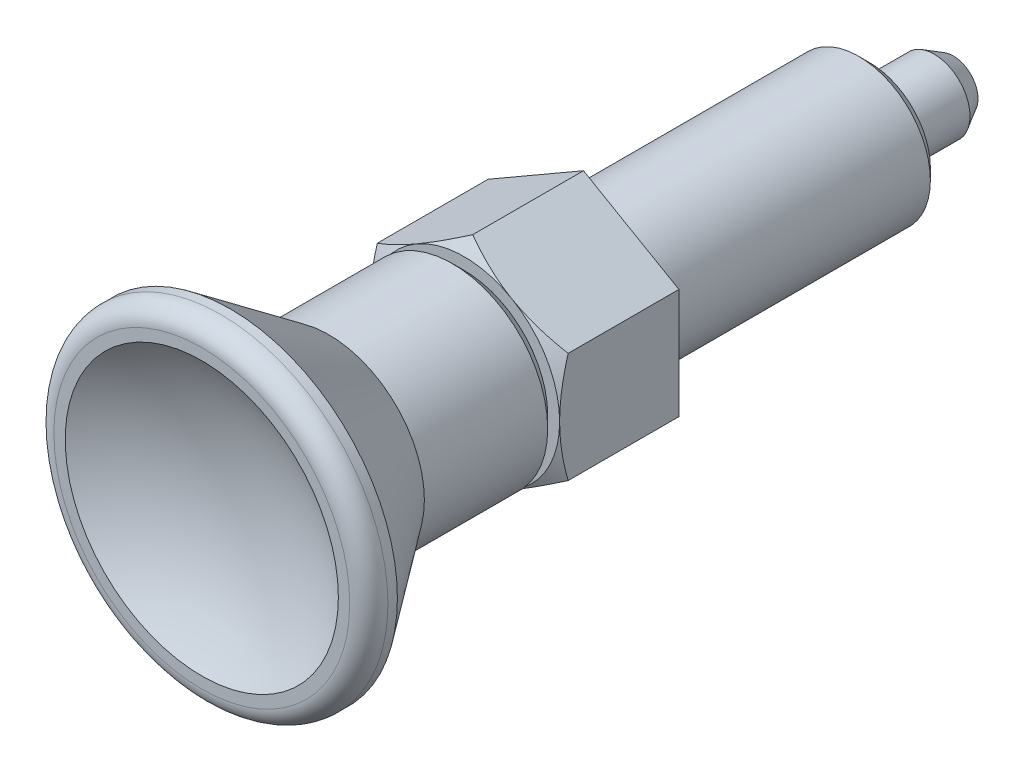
ISO-10303-21;
HEADER;
FILE_DESCRIPTION(('STEP AP214'),'2;1');
FILE_NAME('part.step','',(''),(''),'','','');
FILE_SCHEMA(('AUTOMOTIVE_DESIGN { 1 0 10303 214 1 1 1 1 }'));
ENDSEC;
DATA;
#1=APPLICATION_CONTEXT('core data for automotive mechanical design processes');
#2=APPLICATION_PROTOCOL_DEFINITION('international standard','automotive_design',2000,#1);
#3=PRODUCT_CONTEXT('',#1,'mechanical');
#4=PRODUCT('Part','Part','',(#3));
#5=PRODUCT_RELATED_PRODUCT_CATEGORY('part','',(#4));
#6=PRODUCT_DEFINITION_FORMATION('','',#4);
#7=PRODUCT_DEFINITION_CONTEXT('part definition',#1,'design');
#8=PRODUCT_DEFINITION('design','',#6,#7);
#9=PRODUCT_DEFINITION_SHAPE('','',#8);
#10=(LENGTH_UNIT() NAMED_UNIT(*) SI_UNIT(.MILLI.,.METRE.));
#11=(NAMED_UNIT(*) PLANE_ANGLE_UNIT() SI_UNIT($,.RADIAN.));
#12=(NAMED_UNIT(*) SI_UNIT($,.STERADIAN.) SOLID_ANGLE_UNIT());
#13=UNCERTAINTY_MEASURE_WITH_UNIT(LENGTH_MEASURE(1.E-05),#10,'distance_accuracy_value','');
#14=(GEOMETRIC_REPRESENTATION_CONTEXT(3) GLOBAL_UNCERTAINTY_ASSIGNED_CONTEXT((#13)) GLOBAL_UNIT_ASSIGNED_CONTEXT((#10,
#11,#12)) REPRESENTATION_CONTEXT('',''));
#15=CARTESIAN_POINT('',(0.,0.,0.));
#16=DIRECTION('',(0.,0.,1.));
#17=DIRECTION('',(1.,0.,0.));
#18=AXIS2_PLACEMENT_3D('',#15,#16,#17);
#19=CARTESIAN_POINT('',(4.,2.30940107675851,5.));
#20=DIRECTION('',(-0.5,-0.866025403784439,0.));
#21=DIRECTION('',(0.866025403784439,-0.5,0.));
#22=AXIS2_PLACEMENT_3D('',#19,#20,#21);
#23=PLANE('',#22);
#24=CARTESIAN_POINT('',(4.0002,2.30928560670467,4.64266774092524));
#25=CARTESIAN_POINT('',(3.82442084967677,2.41077174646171,4.70128212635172));
#26=CARTESIAN_POINT('',(3.64712438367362,2.513133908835,4.75458967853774));
#27=CARTESIAN_POINT('',(3.28946140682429,2.71963072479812,4.84763832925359));
#28=CARTESIAN_POINT('',(3.10908854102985,2.82376904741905,4.8873465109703));
#29=CARTESIAN_POINT('',(2.75057818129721,3.03075510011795,4.94915778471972));
#30=CARTESIAN_POINT('',(2.57249584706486,3.13357098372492,4.97167226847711));
#31=CARTESIAN_POINT('',(2.21549328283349,3.33968651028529,4.99854937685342));
#32=CARTESIAN_POINT('',(2.0365743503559,3.44298540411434,5.00293425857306));
#33=CARTESIAN_POINT('',(1.70225715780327,3.63600352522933,4.99380992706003));
#34=CARTESIAN_POINT('',(1.54680884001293,3.72575165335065,4.98254104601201));
#35=CARTESIAN_POINT('',(1.23692494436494,3.90466320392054,4.94682600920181));
#36=CARTESIAN_POINT('',(1.08249043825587,3.99382600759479,4.92236765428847));
#37=CARTESIAN_POINT('',(0.771967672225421,4.17310641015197,4.86122393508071));
#38=CARTESIAN_POINT('',(0.615918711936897,4.26320131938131,4.82427939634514));
#39=CARTESIAN_POINT('',(0.30614816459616,4.44204742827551,4.74042992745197));
#40=CARTESIAN_POINT('',(0.152422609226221,4.53080091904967,4.69354469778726));
#41=CARTESIAN_POINT('',(-0.000199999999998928,4.61891762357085,4.64266774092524));
#42=B_SPLINE_CURVE_WITH_KNOTS('',3,(#24,#25,#26,#27,#28,#29,#30,#31,#32,#33,#34,#35,#36,#37,#38,
#39,#40,#41),.UNSPECIFIED.,.F.,.F.,(4,2,2,2,2,2,2,2,4),(0.,0.634047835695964,1.26961969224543,
1.88946157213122,2.50854226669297,3.04757825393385,3.58711366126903,4.13861653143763,
4.68903648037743),.UNSPECIFIED.);
#43=CARTESIAN_POINT('',(4.,2.30940107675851,4.64273441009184));
#44=VERTEX_POINT('',#43);
#45=CARTESIAN_POINT('',(2.,3.46410161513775,5.));
#46=VERTEX_POINT('',#45);
#47=EDGE_CURVE('E94',#44,#46,#42,.T.);
#48=ORIENTED_EDGE('',*,*,#47,.F.);
#49=DIRECTION('',(0.,0.,-1.));
#50=VECTOR('',#49,1.);
#51=CARTESIAN_POINT('',(4.,2.30940107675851,5.));
#52=LINE('',#51,#50);
#53=CARTESIAN_POINT('',(4.,2.30940107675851,0.));
#54=VERTEX_POINT('',#53);
#55=EDGE_CURVE('E40',#44,#54,#52,.T.);
#56=ORIENTED_EDGE('',*,*,#55,.T.);
#57=DIRECTION('',(-0.866025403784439,0.5,0.));
#58=VECTOR('',#57,1.);
#59=CARTESIAN_POINT('',(4.,2.30940107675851,0.));
#60=LINE('',#59,#58);
#61=CARTESIAN_POINT('',(0.,4.61880215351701,0.));
#62=VERTEX_POINT('',#61);
#63=EDGE_CURVE('E106',#54,#62,#60,.T.);
#64=ORIENTED_EDGE('',*,*,#63,.T.);
#65=DIRECTION('',(0.,0.,-1.));
#66=VECTOR('',#65,1.);
#67=CARTESIAN_POINT('',(0.,4.61880215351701,5.));
#68=LINE('',#67,#66);
#69=CARTESIAN_POINT('',(0.,4.61880215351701,4.64273441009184));
#70=VERTEX_POINT('',#69);
#71=EDGE_CURVE('E133',#70,#62,#68,.T.);
#72=ORIENTED_EDGE('',*,*,#71,.F.);
#73=EDGE_CURVE('E104',#46,#70,#42,.T.);
#74=ORIENTED_EDGE('',*,*,#73,.F.);
#75=EDGE_LOOP('',(#48,#56,#64,#72,#74));
#76=FACE_BOUND('',#75,.T.);
#77=ADVANCED_FACE('F16',(#76),#23,.F.);
#78=CARTESIAN_POINT('',(0.,4.61880215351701,5.));
#79=DIRECTION('',(0.5,-0.866025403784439,0.));
#80=DIRECTION('',(0.866025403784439,0.5,0.));
#81=AXIS2_PLACEMENT_3D('',#78,#79,#80);
#82=PLANE('',#81);
#83=CARTESIAN_POINT('',(0.0002000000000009,4.61891762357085,4.64266774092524));
#84=CARTESIAN_POINT('',(-0.175579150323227,4.51743148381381,4.70128212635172));
#85=CARTESIAN_POINT('',(-0.35287561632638,4.41506932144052,4.75458967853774));
#86=CARTESIAN_POINT('',(-0.710538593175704,4.2085725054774,4.84763832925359));
#87=CARTESIAN_POINT('',(-0.890911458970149,4.10443418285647,4.88734651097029));
#88=CARTESIAN_POINT('',(-1.24942181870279,3.89744813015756,4.94915778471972));
#89=CARTESIAN_POINT('',(-1.42750415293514,3.7946322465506,4.97167226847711));
#90=CARTESIAN_POINT('',(-1.78450671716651,3.58851671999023,4.99854937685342));
#91=CARTESIAN_POINT('',(-1.9634256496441,3.48521782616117,5.00293425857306));
#92=CARTESIAN_POINT('',(-2.29774284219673,3.29219970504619,4.99380992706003));
#93=CARTESIAN_POINT('',(-2.45319115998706,3.20245157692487,4.98254104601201));
#94=CARTESIAN_POINT('',(-2.76307505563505,3.02354002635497,4.94682600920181));
#95=CARTESIAN_POINT('',(-2.91750956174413,2.93437722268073,4.92236765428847));
#96=CARTESIAN_POINT('',(-3.22803232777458,2.75509682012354,4.86122393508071));
#97=CARTESIAN_POINT('',(-3.3840812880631,2.6650019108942,4.82427939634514));
#98=CARTESIAN_POINT('',(-3.69385183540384,2.48615580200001,4.74042992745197));
#99=CARTESIAN_POINT('',(-3.84757739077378,2.39740231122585,4.69354469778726));
#100=CARTESIAN_POINT('',(-4.0002,2.30928560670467,4.64266774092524));
#101=B_SPLINE_CURVE_WITH_KNOTS('',3,(#83,#84,#85,#86,#87,#88,#89,#90,#91,#92,#93,#94,#95,#96,
#97,#98,#99,#100),.UNSPECIFIED.,.F.,.F.,(4,2,2,2,2,2,2,2,4),(0.,0.634047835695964,
1.26961969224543,1.88946157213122,2.50854226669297,3.04757825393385,3.58711366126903,
4.13861653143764,4.68903648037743),.UNSPECIFIED.);
#102=CARTESIAN_POINT('',(-2.,3.46410161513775,5.));
#103=VERTEX_POINT('',#102);
#104=EDGE_CURVE('E202',#70,#103,#101,.T.);
#105=ORIENTED_EDGE('',*,*,#104,.F.);
#106=ORIENTED_EDGE('',*,*,#71,.T.);
#107=DIRECTION('',(-0.866025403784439,-0.5,0.));
#108=VECTOR('',#107,1.);
#109=CARTESIAN_POINT('',(0.,4.61880215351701,0.));
#110=LINE('',#109,#108);
#111=CARTESIAN_POINT('',(-4.,2.30940107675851,0.));
#112=VERTEX_POINT('',#111);
#113=EDGE_CURVE('E285',#62,#112,#110,.T.);
#114=ORIENTED_EDGE('',*,*,#113,.T.);
#115=DIRECTION('',(0.,0.,-1.));
#116=VECTOR('',#115,1.);
#117=CARTESIAN_POINT('',(-4.,2.30940107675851,5.));
#118=LINE('',#117,#116);
#119=CARTESIAN_POINT('',(-4.,2.30940107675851,4.64273441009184));
#120=VERTEX_POINT('',#119);
#121=EDGE_CURVE('E130',#120,#112,#118,.T.);
#122=ORIENTED_EDGE('',*,*,#121,.F.);
#123=EDGE_CURVE('E203',#103,#120,#101,.T.);
#124=ORIENTED_EDGE('',*,*,#123,.F.);
#125=EDGE_LOOP('',(#105,#106,#114,#122,#124));
#126=FACE_BOUND('',#125,.T.);
#127=ADVANCED_FACE('F180',(#126),#82,.F.);
#128=CARTESIAN_POINT('',(-4.,2.30940107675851,5.));
#129=DIRECTION('',(1.,0.,0.));
#130=DIRECTION('',(0.,0.,-1.));
#131=AXIS2_PLACEMENT_3D('',#128,#129,#130);
#132=PLANE('',#131);
#133=CARTESIAN_POINT('',(-4.,6.94219991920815,2.68359881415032));
#134=CARTESIAN_POINT('',(-4.,6.77603569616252,2.76670980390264));
#135=CARTESIAN_POINT('',(-4.,6.6095814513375,2.8492470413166));
#136=CARTESIAN_POINT('',(-4.,6.27596073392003,3.01289674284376));
#137=CARTESIAN_POINT('',(-4.,6.10879421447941,3.09400911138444));
#138=CARTESIAN_POINT('',(-4.,5.77330106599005,3.25468243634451));
#139=CARTESIAN_POINT('',(-4.,5.60497277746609,3.33423993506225));
#140=CARTESIAN_POINT('',(-4.,5.2673392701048,3.49124950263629));
#141=CARTESIAN_POINT('',(-4.,5.09803407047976,3.56870161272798));
#142=CARTESIAN_POINT('',(-4.,4.75061418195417,3.72444133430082));
#143=CARTESIAN_POINT('',(-4.,4.57244587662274,3.8026097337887));
#144=CARTESIAN_POINT('',(-4.,4.21459047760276,3.95538566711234));
#145=CARTESIAN_POINT('',(-4.,4.03490343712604,4.02999332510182));
#146=CARTESIAN_POINT('',(-4.,3.67381380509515,4.17464945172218));
#147=CARTESIAN_POINT('',(-4.,3.49241227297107,4.24470054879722));
#148=CARTESIAN_POINT('',(-4.,3.12748949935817,4.37901752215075));
#149=CARTESIAN_POINT('',(-4.,2.94396849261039,4.44328403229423));
#150=CARTESIAN_POINT('',(-4.,2.53114564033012,4.5786268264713));
#151=CARTESIAN_POINT('',(-4.,2.30119910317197,4.64776652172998));
#152=CARTESIAN_POINT('',(-4.,1.83716013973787,4.77084277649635));
#153=CARTESIAN_POINT('',(-4.,1.60306808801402,4.8247807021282));
#154=CARTESIAN_POINT('',(-4.,1.25115476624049,4.89049433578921));
#155=CARTESIAN_POINT('',(-4.,1.13472020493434,4.90976469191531));
#156=CARTESIAN_POINT('',(-4.,0.901105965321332,4.94302626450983));
#157=CARTESIAN_POINT('',(-4.,0.783926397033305,4.95701824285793));
#158=CARTESIAN_POINT('',(-4.,0.549056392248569,4.97930439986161));
#159=CARTESIAN_POINT('',(-4.,0.43136611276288,4.98760021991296));
#160=CARTESIAN_POINT('',(-4.,0.195714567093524,4.99823203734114));
#161=CARTESIAN_POINT('',(-4.,0.0777533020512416,5.00056805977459));
#162=CARTESIAN_POINT('',(-4.,-0.158841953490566,4.99919469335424));
#163=CARTESIAN_POINT('',(-4.,-0.277475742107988,4.99544901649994));
#164=CARTESIAN_POINT('',(-4.,-0.514393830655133,4.98197915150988));
#165=CARTESIAN_POINT('',(-4.,-0.632678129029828,4.97225493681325));
#166=CARTESIAN_POINT('',(-4.,-0.986685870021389,4.93453988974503));
#167=CARTESIAN_POINT('',(-4.,-1.22152848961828,4.89800700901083));
#168=CARTESIAN_POINT('',(-4.,-1.69131615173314,4.80535547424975));
#169=CARTESIAN_POINT('',(-4.,-1.92619462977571,4.74891340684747));
#170=CARTESIAN_POINT('',(-4.,-2.39194540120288,4.62119578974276));
#171=CARTESIAN_POINT('',(-4.,-2.62281536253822,4.549911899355));
#172=CARTESIAN_POINT('',(-4.,-3.03218850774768,4.41269957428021));
#173=CARTESIAN_POINT('',(-4.,-3.21140125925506,4.34884828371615));
#174=CARTESIAN_POINT('',(-4.,-3.56777859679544,4.21582911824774));
#175=CARTESIAN_POINT('',(-4.,-3.74494373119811,4.14666270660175));
#176=CARTESIAN_POINT('',(-4.,-4.09769114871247,4.00409177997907));
#177=CARTESIAN_POINT('',(-4.,-4.27327226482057,3.93068439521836));
#178=CARTESIAN_POINT('',(-4.,-4.62300750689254,3.78054235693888));
#179=CARTESIAN_POINT('',(-4.,-4.79716158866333,3.70380760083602));
#180=CARTESIAN_POINT('',(-4.,-5.13693923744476,3.55097532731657));
#181=CARTESIAN_POINT('',(-4.,-5.30261242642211,3.47498778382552));
#182=CARTESIAN_POINT('',(-4.,-5.63302677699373,3.32102277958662));
#183=CARTESIAN_POINT('',(-4.,-5.7977679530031,3.24304534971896));
#184=CARTESIAN_POINT('',(-4.,-6.12617341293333,3.08559440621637));
#185=CARTESIAN_POINT('',(-4.,-6.28983908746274,3.00612378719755));
#186=CARTESIAN_POINT('',(-4.,-6.61649594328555,2.84581872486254));
#187=CARTESIAN_POINT('',(-4.,-6.77948714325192,2.76498431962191));
#188=CARTESIAN_POINT('',(-4.,-6.94219991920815,2.68359881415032));
#189=B_SPLINE_CURVE_WITH_KNOTS('',3,(#133,#134,#135,#136,#137,#138,#139,#140,#141,#142,#143,
#144,#145,#146,#147,#148,#149,#150,#151,#152,#153,#154,#155,#156,#157,#158,#159,#160,#161,#162,
#163,#164,#165,#166,#167,#168,#169,#170,#171,#172,#173,#174,#175,#176,#177,#178,#179,#180,#181,
#182,#183,#184,#185,#186,#187,#188),.UNSPECIFIED.,.F.,.F.,(4,2,2,2,2,2,2,2,2,2,2,2,2,2,2,2,2,2,
2,2,2,2,2,2,2,2,2,4),(0.,0.557373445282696,1.11478413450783,1.67331868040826,2.23184227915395,
2.81549662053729,3.39913059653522,3.98242486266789,4.56565513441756,5.28563913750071,
6.00555841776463,6.35951289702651,6.71341626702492,7.06721761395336,7.42101747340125,
7.77693613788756,8.13285638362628,8.84480341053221,9.56889286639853,10.2933903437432,
10.8640406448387,11.4345344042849,12.005418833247,12.5763208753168,13.123110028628,
13.6698907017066,14.215702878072,14.7614998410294),.UNSPECIFIED.);
#190=CARTESIAN_POINT('',(-4.,0.,5.));
#191=VERTEX_POINT('',#190);
#192=EDGE_CURVE('E251',#120,#191,#189,.T.);
#193=ORIENTED_EDGE('',*,*,#192,.F.);
#194=ORIENTED_EDGE('',*,*,#121,.T.);
#195=DIRECTION('',(0.,-1.,0.));
#196=VECTOR('',#195,1.);
#197=CARTESIAN_POINT('',(-4.,2.30940107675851,0.));
#198=LINE('',#197,#196);
#199=CARTESIAN_POINT('',(-4.,-2.30940107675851,0.));
#200=VERTEX_POINT('',#199);
#201=EDGE_CURVE('E287',#112,#200,#198,.T.);
#202=ORIENTED_EDGE('',*,*,#201,.T.);
#203=DIRECTION('',(0.,0.,-1.));
#204=VECTOR('',#203,1.);
#205=CARTESIAN_POINT('',(-4.,-2.30940107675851,5.));
#206=LINE('',#205,#204);
#207=CARTESIAN_POINT('',(-4.,-2.30940107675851,4.64273441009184));
#208=VERTEX_POINT('',#207);
#209=EDGE_CURVE('E127',#208,#200,#206,.T.);
#210=ORIENTED_EDGE('',*,*,#209,.F.);
#211=EDGE_CURVE('E245',#191,#208,#189,.T.);
#212=ORIENTED_EDGE('',*,*,#211,.F.);
#213=EDGE_LOOP('',(#193,#194,#202,#210,#212));
#214=FACE_BOUND('',#213,.T.);
#215=ADVANCED_FACE('F186',(#214),#132,.F.);
#216=CARTESIAN_POINT('',(-4.,-2.30940107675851,5.));
#217=DIRECTION('',(0.5,0.866025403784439,0.));
#218=DIRECTION('',(-0.866025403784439,0.5,0.));
#219=AXIS2_PLACEMENT_3D('',#216,#217,#218);
#220=PLANE('',#219);
#221=CARTESIAN_POINT('',(-4.0002,-2.30928560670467,4.64266774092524));
#222=CARTESIAN_POINT('',(-3.82442084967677,-2.41077174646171,4.70128212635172));
#223=CARTESIAN_POINT('',(-3.64712438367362,-2.513133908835,4.75458967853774));
#224=CARTESIAN_POINT('',(-3.28946140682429,-2.71963072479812,4.84763832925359));
#225=CARTESIAN_POINT('',(-3.10908854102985,-2.82376904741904,4.8873465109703));
#226=CARTESIAN_POINT('',(-2.75057818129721,-3.03075510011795,4.94915778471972));
#227=CARTESIAN_POINT('',(-2.57249584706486,-3.13357098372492,4.97167226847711));
#228=CARTESIAN_POINT('',(-2.2154932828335,-3.33968651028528,4.99854937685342));
#229=CARTESIAN_POINT('',(-2.0365743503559,-3.44298540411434,5.00293425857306));
#230=CARTESIAN_POINT('',(-1.70225715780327,-3.63600352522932,4.99380992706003));
#231=CARTESIAN_POINT('',(-1.54680884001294,-3.72575165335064,4.98254104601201));
#232=CARTESIAN_POINT('',(-1.23692494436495,-3.90466320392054,4.94682600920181));
#233=CARTESIAN_POINT('',(-1.08249043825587,-3.99382600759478,4.92236765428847));
#234=CARTESIAN_POINT('',(-0.771967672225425,-4.17310641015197,4.86122393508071));
#235=CARTESIAN_POINT('',(-0.6159187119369,-4.26320131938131,4.82427939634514));
#236=CARTESIAN_POINT('',(-0.306148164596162,-4.4420474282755,4.74042992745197));
#237=CARTESIAN_POINT('',(-0.152422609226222,-4.53080091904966,4.69354469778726));
#238=CARTESIAN_POINT('',(0.000199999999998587,-4.61891762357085,4.64266774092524));
#239=B_SPLINE_CURVE_WITH_KNOTS('',3,(#221,#222,#223,#224,#225,#226,#227,#228,#229,#230,#231,
#232,#233,#234,#235,#236,#237,#238),.UNSPECIFIED.,.F.,.F.,(4,2,2,2,2,2,2,2,4),(0.,
0.634047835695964,1.26961969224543,1.88946157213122,2.50854226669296,3.04757825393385,
3.58711366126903,4.13861653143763,4.68903648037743),.UNSPECIFIED.);
#240=CARTESIAN_POINT('',(-2.,-3.46410161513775,5.));
#241=VERTEX_POINT('',#240);
#242=EDGE_CURVE('E252',#208,#241,#239,.T.);
#243=ORIENTED_EDGE('',*,*,#242,.F.);
#244=ORIENTED_EDGE('',*,*,#209,.T.);
#245=DIRECTION('',(0.866025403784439,-0.5,0.));
#246=VECTOR('',#245,1.);
#247=CARTESIAN_POINT('',(-4.,-2.30940107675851,0.));
#248=LINE('',#247,#246);
#249=CARTESIAN_POINT('',(0.,-4.61880215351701,0.));
#250=VERTEX_POINT('',#249);
#251=EDGE_CURVE('E292',#200,#250,#248,.T.);
#252=ORIENTED_EDGE('',*,*,#251,.T.);
#253=DIRECTION('',(0.,0.,-1.));
#254=VECTOR('',#253,1.);
#255=CARTESIAN_POINT('',(0.,-4.61880215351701,5.));
#256=LINE('',#255,#254);
#257=CARTESIAN_POINT('',(0.,-4.61880215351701,4.64273441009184));
#258=VERTEX_POINT('',#257);
#259=EDGE_CURVE('E119',#258,#250,#256,.T.);
#260=ORIENTED_EDGE('',*,*,#259,.F.);
#261=EDGE_CURVE('E239',#241,#258,#239,.T.);
#262=ORIENTED_EDGE('',*,*,#261,.F.);
#263=EDGE_LOOP('',(#243,#244,#252,#260,#262));
#264=FACE_BOUND('',#263,.T.);
#265=ADVANCED_FACE('F255',(#264),#220,.F.);
#266=CARTESIAN_POINT('',(0.,-4.61880215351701,5.));
#267=DIRECTION('',(-0.5,0.866025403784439,0.));
#268=DIRECTION('',(-0.866025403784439,-0.5,0.));
#269=AXIS2_PLACEMENT_3D('',#266,#267,#268);
#270=PLANE('',#269);
#271=CARTESIAN_POINT('',(-0.000200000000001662,-4.61891762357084,4.64266774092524));
#272=CARTESIAN_POINT('',(0.175579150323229,-4.5174314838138,4.70128212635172));
#273=CARTESIAN_POINT('',(0.352875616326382,-4.41506932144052,4.75458967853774));
#274=CARTESIAN_POINT('',(0.710538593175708,-4.2085725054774,4.84763832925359));
#275=CARTESIAN_POINT('',(0.890911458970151,-4.10443418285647,4.88734651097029));
#276=CARTESIAN_POINT('',(1.24942181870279,-3.89744813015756,4.94915778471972));
#277=CARTESIAN_POINT('',(1.42750415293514,-3.7946322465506,4.97167226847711));
#278=CARTESIAN_POINT('',(1.78450671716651,-3.58851671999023,4.99854937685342));
#279=CARTESIAN_POINT('',(1.9634256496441,-3.48521782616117,5.00293425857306));
#280=CARTESIAN_POINT('',(2.29774284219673,-3.29219970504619,4.99380992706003));
#281=CARTESIAN_POINT('',(2.45319115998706,-3.20245157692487,4.98254104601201));
#282=CARTESIAN_POINT('',(2.76307505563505,-3.02354002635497,4.94682600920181));
#283=CARTESIAN_POINT('',(2.91750956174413,-2.93437722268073,4.92236765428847));
#284=CARTESIAN_POINT('',(3.22803232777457,-2.75509682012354,4.86122393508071));
#285=CARTESIAN_POINT('',(3.3840812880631,-2.6650019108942,4.82427939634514));
#286=CARTESIAN_POINT('',(3.69385183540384,-2.48615580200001,4.74042992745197));
#287=CARTESIAN_POINT('',(3.84757739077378,-2.39740231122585,4.69354469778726));
#288=CARTESIAN_POINT('',(4.0002,-2.30928560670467,4.64266774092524));
#289=B_SPLINE_CURVE_WITH_KNOTS('',3,(#271,#272,#273,#274,#275,#276,#277,#278,#279,#280,#281,
#282,#283,#284,#285,#286,#287,#288),.UNSPECIFIED.,.F.,.F.,(4,2,2,2,2,2,2,2,4),(0.,
0.634047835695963,1.26961969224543,1.88946157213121,2.50854226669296,3.04757825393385,
3.58711366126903,4.13861653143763,4.68903648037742),.UNSPECIFIED.);
#290=CARTESIAN_POINT('',(2.,-3.46410161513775,5.));
#291=VERTEX_POINT('',#290);
#292=EDGE_CURVE('E343',#258,#291,#289,.T.);
#293=ORIENTED_EDGE('',*,*,#292,.F.);
#294=ORIENTED_EDGE('',*,*,#259,.T.);
#295=DIRECTION('',(0.866025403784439,0.5,0.));
#296=VECTOR('',#295,1.);
#297=CARTESIAN_POINT('',(0.,-4.61880215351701,0.));
#298=LINE('',#297,#296);
#299=CARTESIAN_POINT('',(4.,-2.30940107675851,0.));
#300=VERTEX_POINT('',#299);
#301=EDGE_CURVE('E121',#250,#300,#298,.T.);
#302=ORIENTED_EDGE('',*,*,#301,.T.);
#303=DIRECTION('',(0.,0.,-1.));
#304=VECTOR('',#303,1.);
#305=CARTESIAN_POINT('',(4.,-2.30940107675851,5.));
#306=LINE('',#305,#304);
#307=CARTESIAN_POINT('',(4.,-2.30940107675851,4.64273441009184));
#308=VERTEX_POINT('',#307);
#309=EDGE_CURVE('E113',#308,#300,#306,.T.);
#310=ORIENTED_EDGE('',*,*,#309,.F.);
#311=EDGE_CURVE('E231',#291,#308,#289,.T.);
#312=ORIENTED_EDGE('',*,*,#311,.F.);
#313=EDGE_LOOP('',(#293,#294,#302,#310,#312));
#314=FACE_BOUND('',#313,.T.);
#315=ADVANCED_FACE('F259',(#314),#270,.F.);
#316=CARTESIAN_POINT('',(4.,-2.30940107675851,5.));
#317=DIRECTION('',(-1.,0.,0.));
#318=DIRECTION('',(0.,0.,1.));
#319=AXIS2_PLACEMENT_3D('',#316,#317,#318);
#320=PLANE('',#319);
#321=CARTESIAN_POINT('',(4.,-6.94219991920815,2.68359881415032));
#322=CARTESIAN_POINT('',(4.,-6.77603569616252,2.76670980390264));
#323=CARTESIAN_POINT('',(4.,-6.6095814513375,2.8492470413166));
#324=CARTESIAN_POINT('',(4.,-6.27596073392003,3.01289674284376));
#325=CARTESIAN_POINT('',(4.,-6.10879421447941,3.09400911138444));
#326=CARTESIAN_POINT('',(4.,-5.77330106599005,3.25468243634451));
#327=CARTESIAN_POINT('',(4.,-5.60497277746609,3.33423993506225));
#328=CARTESIAN_POINT('',(4.,-5.2673392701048,3.49124950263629));
#329=CARTESIAN_POINT('',(4.,-5.09803407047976,3.56870161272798));
#330=CARTESIAN_POINT('',(4.,-4.75061418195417,3.72444133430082));
#331=CARTESIAN_POINT('',(4.,-4.57244587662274,3.80260973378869));
#332=CARTESIAN_POINT('',(4.,-4.21459047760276,3.95538566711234));
#333=CARTESIAN_POINT('',(4.,-4.03490343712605,4.02999332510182));
#334=CARTESIAN_POINT('',(4.,-3.67381380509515,4.17464945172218));
#335=CARTESIAN_POINT('',(4.,-3.49241227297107,4.24470054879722));
#336=CARTESIAN_POINT('',(4.,-3.12748949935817,4.37901752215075));
#337=CARTESIAN_POINT('',(4.,-2.94396849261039,4.44328403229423));
#338=CARTESIAN_POINT('',(4.,-2.53114564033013,4.5786268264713));
#339=CARTESIAN_POINT('',(4.,-2.30119910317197,4.64776652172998));
#340=CARTESIAN_POINT('',(4.,-1.83716013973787,4.77084277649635));
#341=CARTESIAN_POINT('',(4.,-1.60306808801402,4.8247807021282));
#342=CARTESIAN_POINT('',(4.,-1.2511547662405,4.89049433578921));
#343=CARTESIAN_POINT('',(4.,-1.13472020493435,4.90976469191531));
#344=CARTESIAN_POINT('',(4.,-0.901105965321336,4.94302626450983));
#345=CARTESIAN_POINT('',(4.,-0.783926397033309,4.95701824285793));
#346=CARTESIAN_POINT('',(4.,-0.549056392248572,4.97930439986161));
#347=CARTESIAN_POINT('',(4.,-0.431366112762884,4.98760021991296));
#348=CARTESIAN_POINT('',(4.,-0.195714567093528,4.99823203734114));
#349=CARTESIAN_POINT('',(4.,-0.077753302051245,5.00056805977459));
#350=CARTESIAN_POINT('',(4.,0.158841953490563,4.99919469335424));
#351=CARTESIAN_POINT('',(4.,0.277475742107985,4.99544901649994));
#352=CARTESIAN_POINT('',(4.,0.514393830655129,4.98197915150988));
#353=CARTESIAN_POINT('',(4.,0.632678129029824,4.97225493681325));
#354=CARTESIAN_POINT('',(4.,0.986685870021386,4.93453988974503));
#355=CARTESIAN_POINT('',(4.,1.22152848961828,4.89800700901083));
#356=CARTESIAN_POINT('',(4.,1.69131615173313,4.80535547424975));
#357=CARTESIAN_POINT('',(4.,1.9261946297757,4.74891340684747));
#358=CARTESIAN_POINT('',(4.,2.39194540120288,4.62119578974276));
#359=CARTESIAN_POINT('',(4.,2.62281536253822,4.549911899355));
#360=CARTESIAN_POINT('',(4.,3.03218850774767,4.41269957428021));
#361=CARTESIAN_POINT('',(4.,3.21140125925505,4.34884828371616));
#362=CARTESIAN_POINT('',(4.,3.56777859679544,4.21582911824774));
#363=CARTESIAN_POINT('',(4.,3.74494373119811,4.14666270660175));
#364=CARTESIAN_POINT('',(4.,4.09769114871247,4.00409177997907));
#365=CARTESIAN_POINT('',(4.,4.27327226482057,3.93068439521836));
#366=CARTESIAN_POINT('',(4.,4.62300750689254,3.78054235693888));
#367=CARTESIAN_POINT('',(4.,4.79716158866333,3.70380760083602));
#368=CARTESIAN_POINT('',(4.,5.13693923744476,3.55097532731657));
#369=CARTESIAN_POINT('',(4.,5.3026124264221,3.47498778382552));
#370=CARTESIAN_POINT('',(4.,5.63302677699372,3.32102277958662));
#371=CARTESIAN_POINT('',(4.,5.7977679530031,3.24304534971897));
#372=CARTESIAN_POINT('',(4.,6.12617341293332,3.08559440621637));
#373=CARTESIAN_POINT('',(4.,6.28983908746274,3.00612378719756));
#374=CARTESIAN_POINT('',(4.,6.61649594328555,2.84581872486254));
#375=CARTESIAN_POINT('',(4.,6.77948714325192,2.76498431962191));
#376=CARTESIAN_POINT('',(4.,6.94219991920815,2.68359881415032));
#377=B_SPLINE_CURVE_WITH_KNOTS('',3,(#321,#322,#323,#324,#325,#326,#327,#328,#329,#330,#331,
#332,#333,#334,#335,#336,#337,#338,#339,#340,#341,#342,#343,#344,#345,#346,#347,#348,#349,#350,
#351,#352,#353,#354,#355,#356,#357,#358,#359,#360,#361,#362,#363,#364,#365,#366,#367,#368,#369,
#370,#371,#372,#373,#374,#375,#376),.UNSPECIFIED.,.F.,.F.,(4,2,2,2,2,2,2,2,2,2,2,2,2,2,2,2,2,2,
2,2,2,2,2,2,2,2,2,4),(0.,0.557373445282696,1.11478413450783,1.67331868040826,2.23184227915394,
2.81549662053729,3.39913059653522,3.98242486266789,4.56565513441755,5.2856391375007,
6.00555841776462,6.35951289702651,6.71341626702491,7.06721761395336,7.42101747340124,
7.77693613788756,8.13285638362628,8.8448034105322,9.56889286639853,10.2933903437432,
10.8640406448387,11.4345344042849,12.005418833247,12.5763208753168,13.123110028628,
13.6698907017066,14.215702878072,14.7614998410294),.UNSPECIFIED.);
#378=CARTESIAN_POINT('',(4.,0.,5.));
#379=VERTEX_POINT('',#378);
#380=EDGE_CURVE('E100',#308,#379,#377,.T.);
#381=ORIENTED_EDGE('',*,*,#380,.F.);
#382=ORIENTED_EDGE('',*,*,#309,.T.);
#383=DIRECTION('',(0.,1.,0.));
#384=VECTOR('',#383,1.);
#385=CARTESIAN_POINT('',(4.,-2.30940107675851,0.));
#386=LINE('',#385,#384);
#387=EDGE_CURVE('E110',#300,#54,#386,.T.);
#388=ORIENTED_EDGE('',*,*,#387,.T.);
#389=ORIENTED_EDGE('',*,*,#55,.F.);
#390=EDGE_CURVE('E92',#379,#44,#377,.T.);
#391=ORIENTED_EDGE('',*,*,#390,.F.);
#392=EDGE_LOOP('',(#381,#382,#388,#389,#391));
#393=FACE_BOUND('',#392,.T.);
#394=ADVANCED_FACE('F108',(#393),#320,.F.);
#395=CARTESIAN_POINT('',(-1.5,0.,-12.));
#396=DIRECTION('',(0.,0.,1.));
#397=DIRECTION('',(1.,0.,0.));
#398=AXIS2_PLACEMENT_3D('',#395,#396,#397);
#399=PLANE('',#398);
#400=CARTESIAN_POINT('',(0.,0.,-12.));
#401=DIRECTION('',(0.,0.,1.));
#402=DIRECTION('',(1.,0.,0.));
#403=AXIS2_PLACEMENT_3D('',#400,#401,#402);
#404=CIRCLE('',#403,2.54);
#405=CARTESIAN_POINT('',(2.54,0.,-12.));
#406=VERTEX_POINT('',#405);
#407=EDGE_CURVE('E152',#406,#406,#404,.F.);
#408=ORIENTED_EDGE('',*,*,#407,.T.);
#409=EDGE_LOOP('',(#408));
#410=FACE_BOUND('',#409,.T.);
#411=CARTESIAN_POINT('',(0.,0.,-12.));
#412=DIRECTION('',(0.,0.,1.));
#413=DIRECTION('',(1.,0.,0.));
#414=AXIS2_PLACEMENT_3D('',#411,#412,#413);
#415=CIRCLE('',#414,1.5);
#416=CARTESIAN_POINT('',(1.5,0.,-12.));
#417=VERTEX_POINT('',#416);
#418=EDGE_CURVE('E140',#417,#417,#415,.T.);
#419=ORIENTED_EDGE('',*,*,#418,.T.);
#420=EDGE_LOOP('',(#419));
#421=FACE_BOUND('',#420,.T.);
#422=ADVANCED_FACE('F266',(#410,#421),#399,.F.);
#423=CARTESIAN_POINT('',(0.,0.,0.));
#424=DIRECTION('',(0.,0.,1.));
#425=DIRECTION('',(1.,0.,0.));
#426=AXIS2_PLACEMENT_3D('',#423,#424,#425);
#427=CYLINDRICAL_SURFACE('',#426,1.5);
#428=CARTESIAN_POINT('',(0.,0.,-14.7));
#429=DIRECTION('',(0.,0.,-1.));
#430=DIRECTION('',(-1.,0.,0.));
#431=AXIS2_PLACEMENT_3D('',#428,#429,#430);
#432=CIRCLE('',#431,1.5);
#433=CARTESIAN_POINT('',(-1.5,0.,-14.7));
#434=VERTEX_POINT('',#433);
#435=EDGE_CURVE('E357',#434,#434,#432,.T.);
#436=ORIENTED_EDGE('',*,*,#435,.F.);
#437=EDGE_LOOP('',(#436));
#438=FACE_BOUND('',#437,.T.);
#439=ORIENTED_EDGE('',*,*,#418,.F.);
#440=EDGE_LOOP('',(#439));
#441=FACE_BOUND('',#440,.T.);
#442=ADVANCED_FACE('F277',(#438,#441),#427,.T.);
#443=CARTESIAN_POINT('',(0.,0.,0.));
#444=DIRECTION('',(0.,0.,1.));
#445=DIRECTION('',(1.,0.,0.));
#446=AXIS2_PLACEMENT_3D('',#443,#444,#445);
#447=CYLINDRICAL_SURFACE('',#446,3.);
#448=CARTESIAN_POINT('',(0.,0.,-11.54));
#449=DIRECTION('',(0.,0.,1.));
#450=DIRECTION('',(1.,0.,0.));
#451=AXIS2_PLACEMENT_3D('',#448,#449,#450);
#452=CIRCLE('',#451,3.);
#453=CARTESIAN_POINT('',(3.,0.,-11.54));
#454=VERTEX_POINT('',#453);
#455=EDGE_CURVE('E148',#454,#454,#452,.T.);
#456=ORIENTED_EDGE('',*,*,#455,.T.);
#457=EDGE_LOOP('',(#456));
#458=FACE_BOUND('',#457,.T.);
#459=CARTESIAN_POINT('',(0.,0.,0.));
#460=DIRECTION('',(0.,0.,1.));
#461=DIRECTION('',(1.,0.,0.));
#462=AXIS2_PLACEMENT_3D('',#459,#460,#461);
#463=CIRCLE('',#462,3.);
#464=CARTESIAN_POINT('',(3.,0.,0.));
#465=VERTEX_POINT('',#464);
#466=EDGE_CURVE('E136',#465,#465,#463,.T.);
#467=ORIENTED_EDGE('',*,*,#466,.F.);
#468=EDGE_LOOP('',(#467));
#469=FACE_BOUND('',#468,.T.);
#470=ADVANCED_FACE('F193',(#458,#469),#447,.T.);
#471=CARTESIAN_POINT('',(0.,0.,0.));
#472=DIRECTION('',(0.,0.,1.));
#473=DIRECTION('',(1.,0.,0.));
#474=AXIS2_PLACEMENT_3D('',#471,#472,#473);
#475=PLANE('',#474);
#476=ORIENTED_EDGE('',*,*,#466,.T.);
#477=EDGE_LOOP('',(#476));
#478=FACE_BOUND('',#477,.T.);
#479=ORIENTED_EDGE('',*,*,#63,.F.);
#480=ORIENTED_EDGE('',*,*,#387,.F.);
#481=ORIENTED_EDGE('',*,*,#301,.F.);
#482=ORIENTED_EDGE('',*,*,#251,.F.);
#483=ORIENTED_EDGE('',*,*,#201,.F.);
#484=ORIENTED_EDGE('',*,*,#113,.F.);
#485=EDGE_LOOP('',(#479,#480,#481,#482,#483,#484));
#486=FACE_BOUND('',#485,.T.);
#487=ADVANCED_FACE('F267',(#478,#486),#475,.F.);
#488=CARTESIAN_POINT('',(0.,0.,5.));
#489=DIRECTION('',(0.,0.,-1.));
#490=DIRECTION('',(-1.,0.,0.));
#491=AXIS2_PLACEMENT_3D('',#488,#489,#490);
#492=CONICAL_SURFACE('',#491,4.,1.0471975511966);
#493=ORIENTED_EDGE('',*,*,#311,.T.);
#494=ORIENTED_EDGE('',*,*,#380,.T.);
#495=CARTESIAN_POINT('',(0.,0.,5.));
#496=DIRECTION('',(0.,0.,1.));
#497=DIRECTION('',(1.,0.,0.));
#498=AXIS2_PLACEMENT_3D('',#495,#496,#497);
#499=CIRCLE('',#498,4.);
#500=EDGE_CURVE('E32',#291,#379,#499,.T.);
#501=ORIENTED_EDGE('',*,*,#500,.F.);
#502=EDGE_LOOP('',(#493,#494,#501));
#503=FACE_BOUND('',#502,.T.);
#504=ADVANCED_FACE('F216',(#503),#492,.T.);
#505=ORIENTED_EDGE('',*,*,#261,.T.);
#506=ORIENTED_EDGE('',*,*,#292,.T.);
#507=EDGE_CURVE('E146',#241,#291,#499,.T.);
#508=ORIENTED_EDGE('',*,*,#507,.F.);
#509=EDGE_LOOP('',(#505,#506,#508));
#510=FACE_BOUND('',#509,.T.);
#511=ADVANCED_FACE('F275',(#510),#492,.T.);
#512=ORIENTED_EDGE('',*,*,#211,.T.);
#513=ORIENTED_EDGE('',*,*,#242,.T.);
#514=EDGE_CURVE('E327',#191,#241,#499,.T.);
#515=ORIENTED_EDGE('',*,*,#514,.F.);
#516=EDGE_LOOP('',(#512,#513,#515));
#517=FACE_BOUND('',#516,.T.);
#518=ADVANCED_FACE('F328',(#517),#492,.T.);
#519=ORIENTED_EDGE('',*,*,#123,.T.);
#520=ORIENTED_EDGE('',*,*,#192,.T.);
#521=EDGE_CURVE('E323',#103,#191,#499,.T.);
#522=ORIENTED_EDGE('',*,*,#521,.F.);
#523=EDGE_LOOP('',(#519,#520,#522));
#524=FACE_BOUND('',#523,.T.);
#525=ADVANCED_FACE('F321',(#524),#492,.T.);
#526=ORIENTED_EDGE('',*,*,#73,.T.);
#527=ORIENTED_EDGE('',*,*,#104,.T.);
#528=EDGE_CURVE('E147',#46,#103,#499,.T.);
#529=ORIENTED_EDGE('',*,*,#528,.F.);
#530=EDGE_LOOP('',(#526,#527,#529));
#531=FACE_BOUND('',#530,.T.);
#532=ADVANCED_FACE('F215',(#531),#492,.T.);
#533=ORIENTED_EDGE('',*,*,#47,.T.);
#534=CARTESIAN_POINT('',(0.,0.,5.));
#535=DIRECTION('',(0.,0.,1.));
#536=DIRECTION('',(1.,0.,0.));
#537=AXIS2_PLACEMENT_3D('',#534,#535,#536);
#538=CIRCLE('',#537,4.);
#539=EDGE_CURVE('E96',#379,#46,#538,.T.);
#540=ORIENTED_EDGE('',*,*,#539,.F.);
#541=ORIENTED_EDGE('',*,*,#390,.T.);
#542=EDGE_LOOP('',(#533,#540,#541));
#543=FACE_BOUND('',#542,.T.);
#544=ADVANCED_FACE('F93',(#543),#492,.T.);
#545=CARTESIAN_POINT('',(0.,0.,5.));
#546=DIRECTION('',(0.,0.,1.));
#547=DIRECTION('',(1.,0.,0.));
#548=AXIS2_PLACEMENT_3D('',#545,#546,#547);
#549=PLANE('',#548);
#550=CARTESIAN_POINT('',(0.,0.,5.));
#551=DIRECTION('',(0.,0.,1.));
#552=DIRECTION('',(1.,0.,0.));
#553=AXIS2_PLACEMENT_3D('',#550,#551,#552);
#554=CIRCLE('',#553,3.5);
#555=CARTESIAN_POINT('',(3.5,0.,5.));
#556=VERTEX_POINT('',#555);
#557=EDGE_CURVE('E339',#556,#556,#554,.T.);
#558=ORIENTED_EDGE('',*,*,#557,.F.);
#559=EDGE_LOOP('',(#558));
#560=FACE_BOUND('',#559,.T.);
#561=ORIENTED_EDGE('',*,*,#500,.T.);
#562=ORIENTED_EDGE('',*,*,#539,.T.);
#563=ORIENTED_EDGE('',*,*,#528,.T.);
#564=ORIENTED_EDGE('',*,*,#521,.T.);
#565=ORIENTED_EDGE('',*,*,#514,.T.);
#566=ORIENTED_EDGE('',*,*,#507,.T.);
#567=EDGE_LOOP('',(#561,#562,#563,#564,#565,#566));
#568=FACE_BOUND('',#567,.T.);
#569=ADVANCED_FACE('F214',(#560,#568),#549,.T.);
#570=CARTESIAN_POINT('',(0.,0.,5.));
#571=DIRECTION('',(0.,0.,1.));
#572=DIRECTION('',(1.,0.,0.));
#573=AXIS2_PLACEMENT_3D('',#570,#571,#572);
#574=CONICAL_SURFACE('',#573,3.5,0.785398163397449);
#575=CARTESIAN_POINT('',(0.,0.,5.5));
#576=DIRECTION('',(0.,0.,1.));
#577=DIRECTION('',(1.,0.,0.));
#578=AXIS2_PLACEMENT_3D('',#575,#576,#577);
#579=CIRCLE('',#578,4.);
#580=CARTESIAN_POINT('',(4.,0.,5.5));
#581=VERTEX_POINT('',#580);
#582=EDGE_CURVE('E341',#581,#581,#579,.T.);
#583=ORIENTED_EDGE('',*,*,#582,.F.);
#584=EDGE_LOOP('',(#583));
#585=FACE_BOUND('',#584,.T.);
#586=ORIENTED_EDGE('',*,*,#557,.T.);
#587=EDGE_LOOP('',(#586));
#588=FACE_BOUND('',#587,.T.);
#589=ADVANCED_FACE('F217',(#585,#588),#574,.T.);
#590=CARTESIAN_POINT('',(0.,0.,0.));
#591=DIRECTION('',(0.,0.,1.));
#592=DIRECTION('',(1.,0.,0.));
#593=AXIS2_PLACEMENT_3D('',#590,#591,#592);
#594=CYLINDRICAL_SURFACE('',#593,4.);
#595=CARTESIAN_POINT('',(0.,0.,10.67));
#596=DIRECTION('',(0.,0.,1.));
#597=DIRECTION('',(1.,0.,0.));
#598=AXIS2_PLACEMENT_3D('',#595,#596,#597);
#599=CIRCLE('',#598,4.);
#600=CARTESIAN_POINT('',(4.,0.,10.67));
#601=VERTEX_POINT('',#600);
#602=EDGE_CURVE('E351',#601,#601,#599,.T.);
#603=ORIENTED_EDGE('',*,*,#602,.F.);
#604=EDGE_LOOP('',(#603));
#605=FACE_BOUND('',#604,.T.);
#606=ORIENTED_EDGE('',*,*,#582,.T.);
#607=EDGE_LOOP('',(#606));
#608=FACE_BOUND('',#607,.T.);
#609=ADVANCED_FACE('F383',(#605,#608),#594,.T.);
#610=CARTESIAN_POINT('',(0.,0.,10.67));
#611=DIRECTION('',(0.,0.,1.));
#612=DIRECTION('',(1.,0.,0.));
#613=AXIS2_PLACEMENT_3D('',#610,#611,#612);
#614=CONICAL_SURFACE('',#613,4.,0.628220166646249);
#615=CARTESIAN_POINT('',(0.,0.,14.8));
#616=DIRECTION('',(0.,0.,1.));
#617=DIRECTION('',(1.,0.,0.));
#618=AXIS2_PLACEMENT_3D('',#615,#616,#617);
#619=CIRCLE('',#618,7.);
#620=CARTESIAN_POINT('',(7.,0.,14.8));
#621=VERTEX_POINT('',#620);
#622=EDGE_CURVE('E354',#621,#621,#619,.T.);
#623=ORIENTED_EDGE('',*,*,#622,.F.);
#624=EDGE_LOOP('',(#623));
#625=FACE_BOUND('',#624,.T.);
#626=ORIENTED_EDGE('',*,*,#602,.T.);
#627=EDGE_LOOP('',(#626));
#628=FACE_BOUND('',#627,.T.);
#629=ADVANCED_FACE('F377',(#625,#628),#614,.T.);
#630=CARTESIAN_POINT('',(0.,0.,0.));
#631=DIRECTION('',(0.,0.,1.));
#632=DIRECTION('',(1.,0.,0.));
#633=AXIS2_PLACEMENT_3D('',#630,#631,#632);
#634=CYLINDRICAL_SURFACE('',#633,7.);
#635=CARTESIAN_POINT('',(0.,0.,15.2));
#636=DIRECTION('',(0.,0.,-1.));
#637=DIRECTION('',(-1.,0.,0.));
#638=AXIS2_PLACEMENT_3D('',#635,#636,#637);
#639=CIRCLE('',#638,7.);
#640=CARTESIAN_POINT('',(-7.,0.,15.2));
#641=VERTEX_POINT('',#640);
#642=EDGE_CURVE('E10',#641,#641,#639,.T.);
#643=ORIENTED_EDGE('',*,*,#642,.T.);
#644=EDGE_LOOP('',(#643));
#645=FACE_BOUND('',#644,.T.);
#646=ORIENTED_EDGE('',*,*,#622,.T.);
#647=EDGE_LOOP('',(#646));
#648=FACE_BOUND('',#647,.T.);
#649=ADVANCED_FACE('F369',(#645,#648),#634,.T.);
#650=CARTESIAN_POINT('',(-7.,0.,16.));
#651=DIRECTION('',(0.,0.,-1.));
#652=DIRECTION('',(-1.,0.,0.));
#653=AXIS2_PLACEMENT_3D('',#650,#651,#652);
#654=PLANE('',#653);
#655=CARTESIAN_POINT('',(0.,0.,16.));
#656=DIRECTION('',(0.,0.,1.));
#657=DIRECTION('',(1.,0.,0.));
#658=AXIS2_PLACEMENT_3D('',#655,#656,#657);
#659=CIRCLE('',#658,5.725);
#660=CARTESIAN_POINT('',(5.725,0.,16.));
#661=VERTEX_POINT('',#660);
#662=EDGE_CURVE('E337',#661,#661,#659,.T.);
#663=ORIENTED_EDGE('',*,*,#662,.F.);
#664=EDGE_LOOP('',(#663));
#665=FACE_BOUND('',#664,.T.);
#666=CARTESIAN_POINT('',(0.,0.,16.));
#667=DIRECTION('',(0.,0.,-1.));
#668=DIRECTION('',(-1.,0.,0.));
#669=AXIS2_PLACEMENT_3D('',#666,#667,#668);
#670=CIRCLE('',#669,6.2);
#671=CARTESIAN_POINT('',(-6.2,0.,16.));
#672=VERTEX_POINT('',#671);
#673=EDGE_CURVE('E25',#672,#672,#670,.F.);
#674=ORIENTED_EDGE('',*,*,#673,.T.);
#675=EDGE_LOOP('',(#674));
#676=FACE_BOUND('',#675,.T.);
#677=ADVANCED_FACE('F161',(#665,#676),#654,.F.);
#678=CARTESIAN_POINT('',(0.,0.,-11.54));
#679=DIRECTION('',(0.,0.,1.));
#680=DIRECTION('',(1.,0.,0.));
#681=AXIS2_PLACEMENT_3D('',#678,#679,#680);
#682=CONICAL_SURFACE('',#681,3.,0.78539816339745);
#683=ORIENTED_EDGE('',*,*,#407,.F.);
#684=EDGE_LOOP('',(#683));
#685=FACE_BOUND('',#684,.T.);
#686=ORIENTED_EDGE('',*,*,#455,.F.);
#687=EDGE_LOOP('',(#686));
#688=FACE_BOUND('',#687,.T.);
#689=ADVANCED_FACE('F368',(#685,#688),#682,.T.);
#690=CARTESIAN_POINT('',(0.,0.,-14.7));
#691=DIRECTION('',(0.,0.,1.));
#692=DIRECTION('',(1.,0.,0.));
#693=AXIS2_PLACEMENT_3D('',#690,#691,#692);
#694=CONICAL_SURFACE('',#693,1.5,0.523598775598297);
#695=CARTESIAN_POINT('',(0.,0.,-15.5));
#696=DIRECTION('',(0.,0.,-1.));
#697=DIRECTION('',(-1.,0.,0.));
#698=AXIS2_PLACEMENT_3D('',#695,#696,#697);
#699=CIRCLE('',#698,1.0381197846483);
#700=CARTESIAN_POINT('',(-1.0381197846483,0.,-15.5));
#701=VERTEX_POINT('',#700);
#702=EDGE_CURVE('E361',#701,#701,#699,.T.);
#703=ORIENTED_EDGE('',*,*,#702,.F.);
#704=EDGE_LOOP('',(#703));
#705=FACE_BOUND('',#704,.T.);
#706=ORIENTED_EDGE('',*,*,#435,.T.);
#707=EDGE_LOOP('',(#706));
#708=FACE_BOUND('',#707,.T.);
#709=ADVANCED_FACE('F175',(#705,#708),#694,.T.);
#710=CARTESIAN_POINT('',(0.,0.,-15.5));
#711=DIRECTION('',(0.,0.,1.));
#712=DIRECTION('',(1.,0.,0.));
#713=AXIS2_PLACEMENT_3D('',#710,#711,#712);
#714=PLANE('',#713);
#715=ORIENTED_EDGE('',*,*,#702,.T.);
#716=EDGE_LOOP('',(#715));
#717=FACE_BOUND('',#716,.T.);
#718=ADVANCED_FACE('F165',(#717),#714,.F.);
#719=CARTESIAN_POINT('',(0.,0.,15.2));
#720=DIRECTION('',(0.,0.,-1.));
#721=DIRECTION('',(-1.,0.,0.));
#722=AXIS2_PLACEMENT_3D('',#719,#720,#721);
#723=TOROIDAL_SURFACE('',#722,6.2,0.8);
#724=ORIENTED_EDGE('',*,*,#642,.F.);
#725=EDGE_LOOP('',(#724));
#726=FACE_BOUND('',#725,.T.);
#727=ORIENTED_EDGE('',*,*,#673,.F.);
#728=EDGE_LOOP('',(#727));
#729=FACE_BOUND('',#728,.T.);
#730=ADVANCED_FACE('F18',(#726,#729),#723,.T.);
#731=CARTESIAN_POINT('',(0.,0.,24.1990472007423));
#732=DIRECTION('',(0.,0.,1.));
#733=DIRECTION('',(1.,0.,0.));
#734=AXIS2_PLACEMENT_3D('',#731,#732,#733);
#735=SPHERICAL_SURFACE('',#734,10.);
#736=ORIENTED_EDGE('',*,*,#662,.T.);
#737=EDGE_LOOP('',(#736));
#738=FACE_BOUND('',#737,.T.);
#739=ADVANCED_FACE('F164',(#738),#735,.F.);
#740=CLOSED_SHELL('',(#77,#127,#215,#265,#315,#394,#422,#442,#470,#487,#504,#511,#518,#525,#532,
#544,#569,#589,#609,#629,#649,#677,#689,#709,#718,#730,#739));
#741=MANIFOLD_SOLID_BREP('B1',#740);
#742=ADVANCED_BREP_SHAPE_REPRESENTATION('',(#18,#741),#14);
#743=SHAPE_DEFINITION_REPRESENTATION(#9,#742);
ENDSEC;
END-ISO-10303-21;
